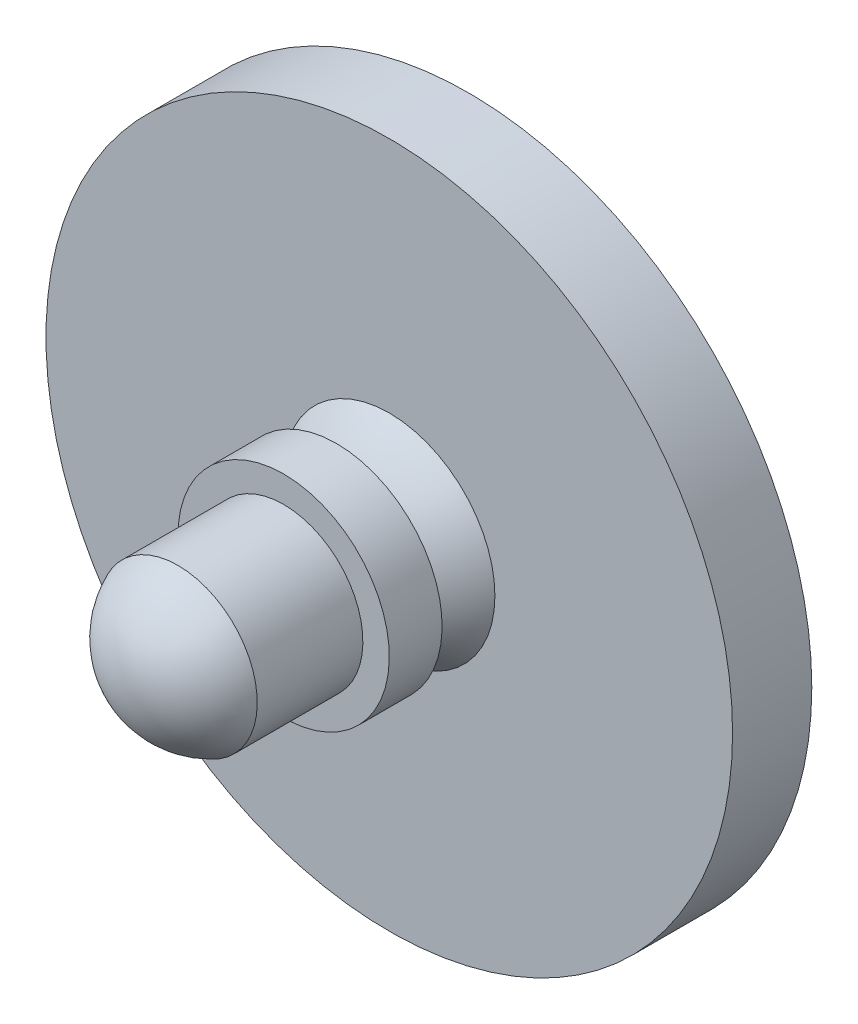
from build123d import *

# Parameters (mm, degrees)
ESQUISSE1_R      = 6.5
EXTRUSION1_DEPTH = 1.5


with BuildPart() as part:
    # Esquisse1 → Extrusion1 (new body)
    with BuildSketch(Plane.XY):
        Circle(ESQUISSE1_R)
    extrude(amount=EXTRUSION1_DEPTH)

    # Esquisse3 → R_volution4 (revolve)
    with BuildSketch(Plane(origin=(0, 0, 0), x_dir=(1, 0, 0), z_dir=(0, 1, 0))):
        with BuildLine():
            Line((2.5, 0), (0, 0))
            Line((0, 0), (0, 2))
            ThreePointArc((0, 2), (1.600781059, 1.438476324), (2.5, 0))
        make_face()
    revolve(axis=Axis((0, 0, 0), (0, 0, -1)))

    # Esquisse4 → R_volution5 (revolve)
    with BuildSketch(Plane(origin=(0, 0, 0), x_dir=(0, 0, -1), z_dir=(1, 0, 0))):
        with BuildLine():
            Line((-1.5, 2), (-1.5, 0))
            Line((-1.5, 0), (-2.5, 0))
            ThreePointArc((-2.5, 0), (-2.236067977, 1.118033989), (-1.5, 2))
        make_face()
    revolve(axis=Axis((0, 0, 0), (0, 0, 1)))


with BuildPart() as body_2:
    # Esquisse5 → R_volution6 (revolve)
    with BuildSketch(Plane(origin=(0, 0, 0), x_dir=(0, 0, -1), z_dir=(1, 0, 0))):
        with BuildLine():
            Line((-2.5, 0), (-2.5, 2))
            Line((-2.5, 2), (-3.5, 2))
            Line((-3.5, 2), (-3.5, 1.5))
            Line((-3.5, 1.5), (-5.5, 1.5))
            ThreePointArc((-5.5, 1.5), (-6.227081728, 0.901387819), (-6.5, 0))
            Line((-6.5, 0), (-2.5, 0))
        make_face()
    revolve(axis=Axis((0, 0, 0), (0, 0, 1)))


solid = Compound([part.part, body_2.part])
